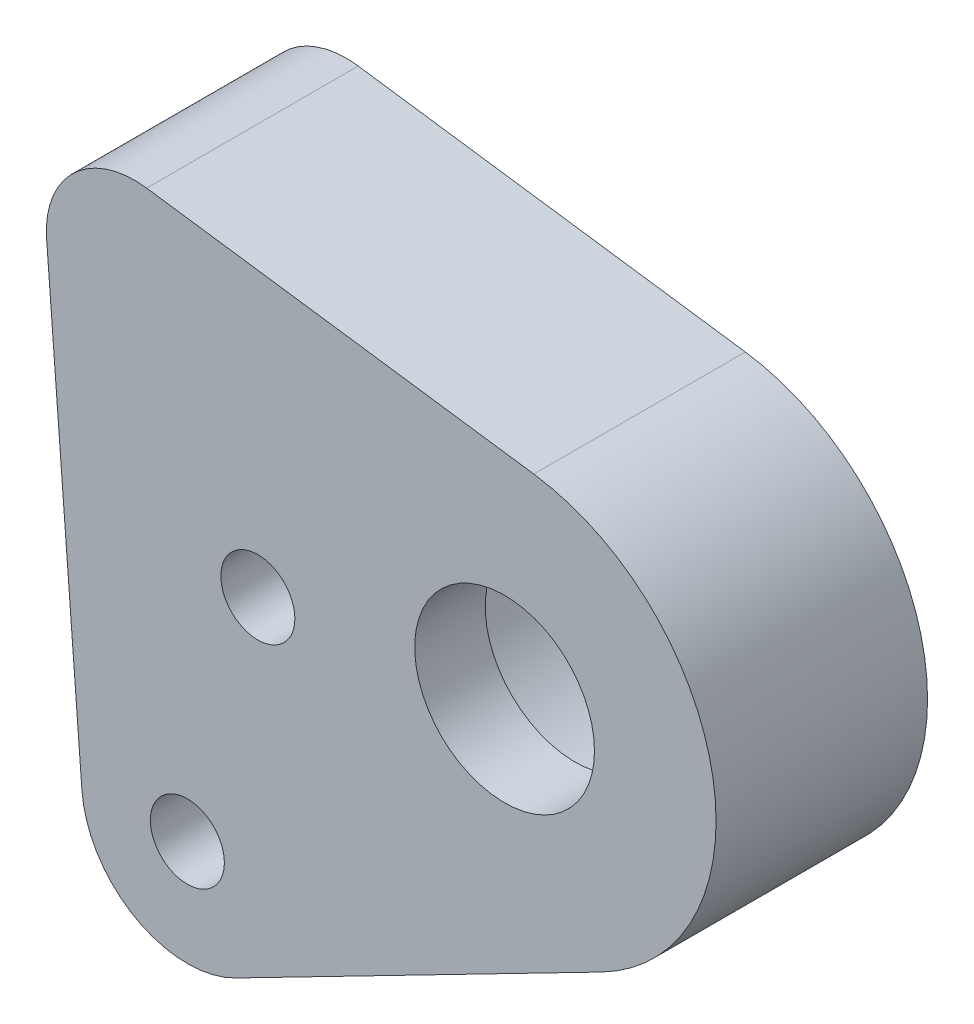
from build123d import *

# Parameters (mm, degrees)
SK_BASE_CON_ALOJAMIENTO_MUELLE_R   = 9
SK_BASE_CON_ALOJAMIENTO_MUELLE_R_2 = 2.1
BASE_CON_ALOJAMIENTO_MUELLE_DEPTH  = 8
SK_TAPA_R                          = 5.1
SK_TAPA_R_2                        = 2.1
TAPA_DEPTH                         = 4


with BuildPart() as part:
    # Sk_Base_con_alojamiento_muelle → Base_con_alojamiento_muelle (new body)
    with BuildSketch(Plane.XY.offset(54.4)):
        with BuildLine():
            Line((-31.985315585, -16.382921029), (-29.982378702, -42.459505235))
            ThreePointArc((-29.982378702, -42.459505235), (-26.927186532, -47.237516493), (-21.25674909, -47.336157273))
            Line((-21.25674909, -47.336157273), (-0.513498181, -36.672314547))
            ThreePointArc((-0.513498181, -36.672314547), (5.830926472, -23.992718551), (-4.340612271, -14.115285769))
            Line((-4.340612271, -14.115285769), (-26.308588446, -11.048035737))
            ThreePointArc((-26.308588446, -11.048035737), (-30.424128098, -12.356465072), (-31.985315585, -16.382921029))
        make_face()
        with Locations((-6, -26)):
            Circle(SK_BASE_CON_ALOJAMIENTO_MUELLE_R, mode=Mode.SUBTRACT)
        with Locations((-20, -28)):
            Circle(SK_BASE_CON_ALOJAMIENTO_MUELLE_R_2, mode=Mode.SUBTRACT)
        with Locations((-24, -42)):
            Circle(SK_BASE_CON_ALOJAMIENTO_MUELLE_R_2, mode=Mode.SUBTRACT)
    extrude(amount=BASE_CON_ALOJAMIENTO_MUELLE_DEPTH)

    # Sk_Tapa → Tapa (add)
    with BuildSketch(Plane.XY.offset(62.4)):
        with BuildLine():
            Line((-31.985315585, -16.382921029), (-29.982378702, -42.459505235))
            ThreePointArc((-29.982378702, -42.459505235), (-26.927186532, -47.237516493), (-21.25674909, -47.336157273))
            Line((-21.25674909, -47.336157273), (-0.513498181, -36.672314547))
            ThreePointArc((-0.513498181, -36.672314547), (5.830926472, -23.992718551), (-4.340612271, -14.115285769))
            Line((-4.340612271, -14.115285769), (-26.308588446, -11.048035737))
            ThreePointArc((-26.308588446, -11.048035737), (-30.424128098, -12.356465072), (-31.985315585, -16.382921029))
        make_face()
        with Locations((-6, -26)):
            Circle(SK_TAPA_R, mode=Mode.SUBTRACT)
        with Locations((-20, -28)):
            Circle(SK_TAPA_R_2, mode=Mode.SUBTRACT)
        with Locations((-24, -42)):
            Circle(SK_TAPA_R_2, mode=Mode.SUBTRACT)
    extrude(amount=TAPA_DEPTH)


solid = part.part
